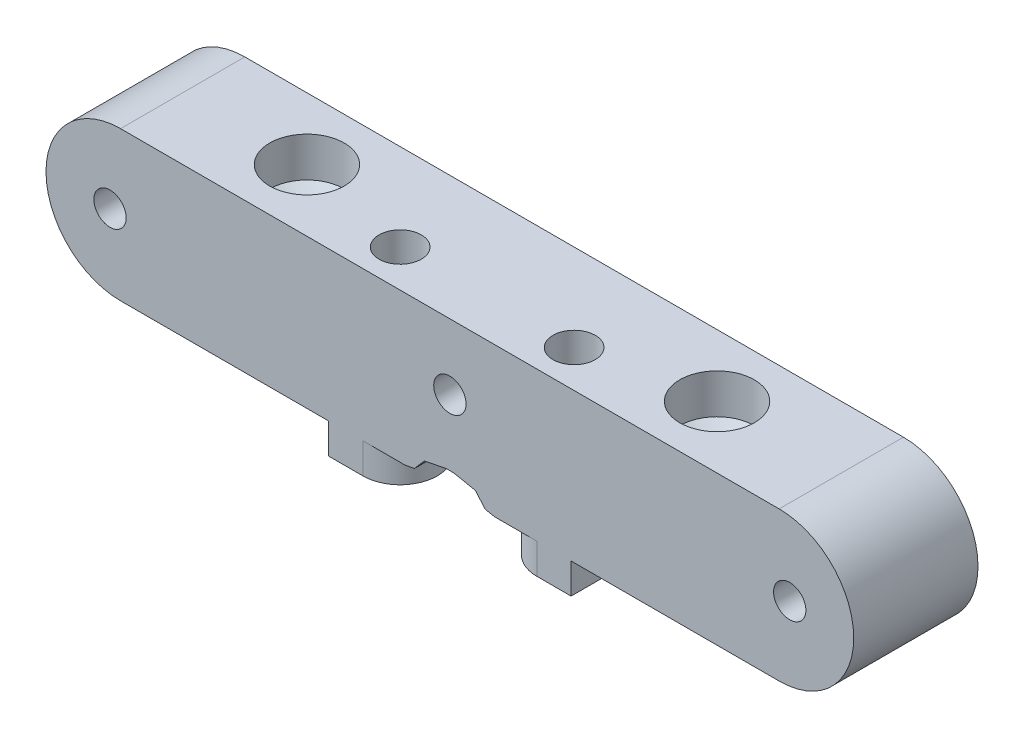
ISO-10303-21;
HEADER;
FILE_DESCRIPTION(('STEP AP214'),'2;1');
FILE_NAME('part.step','',(''),(''),'','','');
FILE_SCHEMA(('AUTOMOTIVE_DESIGN { 1 0 10303 214 1 1 1 1 }'));
ENDSEC;
DATA;
#1=APPLICATION_CONTEXT('core data for automotive mechanical design processes');
#2=APPLICATION_PROTOCOL_DEFINITION('international standard','automotive_design',2000,#1);
#3=PRODUCT_CONTEXT('',#1,'mechanical');
#4=PRODUCT('Part','Part','',(#3));
#5=PRODUCT_RELATED_PRODUCT_CATEGORY('part','',(#4));
#6=PRODUCT_DEFINITION_FORMATION('','',#4);
#7=PRODUCT_DEFINITION_CONTEXT('part definition',#1,'design');
#8=PRODUCT_DEFINITION('design','',#6,#7);
#9=PRODUCT_DEFINITION_SHAPE('','',#8);
#10=(LENGTH_UNIT() NAMED_UNIT(*) SI_UNIT(.MILLI.,.METRE.));
#11=(NAMED_UNIT(*) PLANE_ANGLE_UNIT() SI_UNIT($,.RADIAN.));
#12=(NAMED_UNIT(*) SI_UNIT($,.STERADIAN.) SOLID_ANGLE_UNIT());
#13=UNCERTAINTY_MEASURE_WITH_UNIT(LENGTH_MEASURE(1.E-05),#10,'distance_accuracy_value','');
#14=(GEOMETRIC_REPRESENTATION_CONTEXT(3) GLOBAL_UNCERTAINTY_ASSIGNED_CONTEXT((#13)) GLOBAL_UNIT_ASSIGNED_CONTEXT((#10,
#11,#12)) REPRESENTATION_CONTEXT('',''));
#15=CARTESIAN_POINT('',(0.,0.,0.));
#16=DIRECTION('',(0.,0.,1.));
#17=DIRECTION('',(1.,0.,0.));
#18=AXIS2_PLACEMENT_3D('',#15,#16,#17);
#19=CARTESIAN_POINT('',(-1.75009586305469E-10,55.1652977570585,0.));
#20=DIRECTION('',(3.17245792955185E-12,-1.,0.));
#21=DIRECTION('',(1.,3.17245792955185E-12,0.));
#22=AXIS2_PLACEMENT_3D('',#19,#20,#21);
#23=PLANE('',#22);
#24=CARTESIAN_POINT('',(2.49999999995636,55.1652977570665,-5.));
#25=DIRECTION('',(-3.17245792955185E-12,1.,0.));
#26=DIRECTION('',(-1.,-3.17245792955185E-12,0.));
#27=AXIS2_PLACEMENT_3D('',#24,#25,#26);
#28=CIRCLE('',#27,1.7);
#29=CARTESIAN_POINT('',(0.799999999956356,55.1652977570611,-5.));
#30=VERTEX_POINT('',#29);
#31=EDGE_CURVE('E368',#30,#30,#28,.T.);
#32=ORIENTED_EDGE('',*,*,#31,.T.);
#33=EDGE_LOOP('',(#32));
#34=FACE_BOUND('',#33,.T.);
#35=DIRECTION('',(1.,3.17245792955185E-12,0.));
#36=VECTOR('',#35,1.);
#37=CARTESIAN_POINT('',(-3.50000000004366,55.1652977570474,0.));
#38=LINE('',#37,#36);
#39=CARTESIAN_POINT('',(12.0000309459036,55.1652977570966,0.));
#40=VERTEX_POINT('',#39);
#41=CARTESIAN_POINT('',(15.4049397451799,55.1652977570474,0.));
#42=VERTEX_POINT('',#41);
#43=EDGE_CURVE('E381',#40,#42,#38,.T.);
#44=ORIENTED_EDGE('',*,*,#43,.F.);
#45=CARTESIAN_POINT('',(12.0000309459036,55.1652977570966,-3.00000000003));
#46=DIRECTION('',(3.17245792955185E-12,-1.,0.));
#47=DIRECTION('',(1.,3.17245792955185E-12,0.));
#48=AXIS2_PLACEMENT_3D('',#45,#46,#47);
#49=CIRCLE('',#48,3.00000000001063);
#50=CARTESIAN_POINT('',(12.0000309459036,55.1652977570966,-6.00000000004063));
#51=VERTEX_POINT('',#50);
#52=EDGE_CURVE('E60',#51,#40,#49,.T.);
#53=ORIENTED_EDGE('',*,*,#52,.F.);
#54=DIRECTION('',(1.,3.17251022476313E-12,-1.47436747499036E-11));
#55=VECTOR('',#54,1.);
#56=CARTESIAN_POINT('',(12.0000309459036,55.1652977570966,-6.00000000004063));
#57=LINE('',#56,#55);
#58=CARTESIAN_POINT('',(9.24416707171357,55.1652977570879,-6.));
#59=VERTEX_POINT('',#58);
#60=EDGE_CURVE('E266',#59,#51,#57,.T.);
#61=ORIENTED_EDGE('',*,*,#60,.F.);
#62=DIRECTION('',(-7.49978782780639E-12,0.,-1.));
#63=VECTOR('',#62,1.);
#64=CARTESIAN_POINT('',(9.24416707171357,55.1652977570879,-6.));
#65=LINE('',#64,#63);
#66=CARTESIAN_POINT('',(9.24416707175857,55.1652977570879,0.));
#67=VERTEX_POINT('',#66);
#68=EDGE_CURVE('E275',#67,#59,#65,.T.);
#69=ORIENTED_EDGE('',*,*,#68,.F.);
#70=CARTESIAN_POINT('',(-7.5000000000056,55.1652977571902,0.));
#71=VERTEX_POINT('',#70);
#72=EDGE_CURVE('E376',#71,#67,#38,.T.);
#73=ORIENTED_EDGE('',*,*,#72,.F.);
#74=DIRECTION('',(0.,0.,-1.));
#75=VECTOR('',#74,1.);
#76=CARTESIAN_POINT('',(-7.5000000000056,55.1652977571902,15.6204993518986));
#77=LINE('',#76,#75);
#78=CARTESIAN_POINT('',(-7.5000000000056,55.1652977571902,-9.99999999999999));
#79=VERTEX_POINT('',#78);
#80=EDGE_CURVE('E206',#71,#79,#77,.T.);
#81=ORIENTED_EDGE('',*,*,#80,.T.);
#82=DIRECTION('',(-1.,-3.17245792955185E-12,0.));
#83=VECTOR('',#82,1.);
#84=CARTESIAN_POINT('',(-3.50000000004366,55.1652977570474,-9.99999999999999));
#85=LINE('',#84,#83);
#86=CARTESIAN_POINT('',(15.4049397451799,55.1652977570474,-9.99999999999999));
#87=VERTEX_POINT('',#86);
#88=EDGE_CURVE('E211',#87,#79,#85,.T.);
#89=ORIENTED_EDGE('',*,*,#88,.F.);
#90=DIRECTION('',(0.,0.,-1.));
#91=VECTOR('',#90,1.);
#92=CARTESIAN_POINT('',(15.4049397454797,55.1652977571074,0.));
#93=LINE('',#92,#91);
#94=EDGE_CURVE('E366',#42,#87,#93,.T.);
#95=ORIENTED_EDGE('',*,*,#94,.F.);
#96=EDGE_LOOP('',(#44,#53,#61,#69,#73,#81,#89,#95));
#97=FACE_BOUND('',#96,.T.);
#98=ADVANCED_FACE('F40',(#34,#97),#23,.T.);
#99=CARTESIAN_POINT('',(35.500059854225,55.1652977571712,-5.));
#100=DIRECTION('',(-3.17245792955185E-12,1.,0.));
#101=DIRECTION('',(-1.,-3.17245792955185E-12,0.));
#102=AXIS2_PLACEMENT_3D('',#99,#100,#101);
#103=CIRCLE('',#102,1.7);
#104=CARTESIAN_POINT('',(33.800059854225,55.1652977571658,-5.));
#105=VERTEX_POINT('',#104);
#106=EDGE_CURVE('E372',#105,#105,#103,.T.);
#107=ORIENTED_EDGE('',*,*,#106,.T.);
#108=EDGE_LOOP('',(#107));
#109=FACE_BOUND('',#108,.T.);
#110=DIRECTION('',(1.,3.17251022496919E-12,1.43609592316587E-11));
#111=VECTOR('',#110,1.);
#112=CARTESIAN_POINT('',(28.7558948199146,55.1652977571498,-6.));
#113=LINE('',#112,#111);
#114=CARTESIAN_POINT('',(26.0000309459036,55.165297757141,-6.00000000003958));
#115=VERTEX_POINT('',#114);
#116=CARTESIAN_POINT('',(28.7558948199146,55.1652977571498,-6.));
#117=VERTEX_POINT('',#116);
#118=EDGE_CURVE('E301',#115,#117,#113,.T.);
#119=ORIENTED_EDGE('',*,*,#118,.F.);
#120=CARTESIAN_POINT('',(26.0000309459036,55.165297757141,-3.00000000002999));
#121=DIRECTION('',(3.17245792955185E-12,-1.,0.));
#122=DIRECTION('',(1.,3.17245792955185E-12,0.));
#123=AXIS2_PLACEMENT_3D('',#120,#121,#122);
#124=CIRCLE('',#123,3.00000000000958);
#125=CARTESIAN_POINT('',(26.0000380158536,55.165297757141,-2.87426332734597E-11));
#126=VERTEX_POINT('',#125);
#127=EDGE_CURVE('E299',#126,#115,#124,.T.);
#128=ORIENTED_EDGE('',*,*,#127,.F.);
#129=CARTESIAN_POINT('',(22.5951221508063,55.1652977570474,0.));
#130=VERTEX_POINT('',#129);
#131=EDGE_CURVE('E382',#130,#126,#38,.T.);
#132=ORIENTED_EDGE('',*,*,#131,.F.);
#133=DIRECTION('',(0.,0.,1.));
#134=VECTOR('',#133,1.);
#135=CARTESIAN_POINT('',(22.5951221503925,55.1652977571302,0.));
#136=LINE('',#135,#134);
#137=CARTESIAN_POINT('',(22.5951221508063,55.1652977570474,-9.99999999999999));
#138=VERTEX_POINT('',#137);
#139=EDGE_CURVE('E353',#138,#130,#136,.T.);
#140=ORIENTED_EDGE('',*,*,#139,.F.);
#141=CARTESIAN_POINT('',(45.5000618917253,55.1652977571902,-9.99999999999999));
#142=VERTEX_POINT('',#141);
#143=EDGE_CURVE('E196',#142,#138,#85,.T.);
#144=ORIENTED_EDGE('',*,*,#143,.F.);
#145=DIRECTION('',(0.,0.,-1.));
#146=VECTOR('',#145,1.);
#147=CARTESIAN_POINT('',(45.5000618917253,55.1652977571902,15.6204993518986));
#148=LINE('',#147,#146);
#149=CARTESIAN_POINT('',(45.5000618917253,55.1652977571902,0.));
#150=VERTEX_POINT('',#149);
#151=EDGE_CURVE('E227',#150,#142,#148,.T.);
#152=ORIENTED_EDGE('',*,*,#151,.F.);
#153=CARTESIAN_POINT('',(28.7558948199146,55.1652977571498,0.));
#154=VERTEX_POINT('',#153);
#155=EDGE_CURVE('E374',#154,#150,#38,.T.);
#156=ORIENTED_EDGE('',*,*,#155,.F.);
#157=DIRECTION('',(-1.71107341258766E-11,0.,1.));
#158=VECTOR('',#157,1.);
#159=CARTESIAN_POINT('',(28.7558948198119,55.1652977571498,0.));
#160=LINE('',#159,#158);
#161=EDGE_CURVE('E293',#117,#154,#160,.T.);
#162=ORIENTED_EDGE('',*,*,#161,.F.);
#163=EDGE_LOOP('',(#119,#128,#132,#140,#144,#152,#156,#162));
#164=FACE_BOUND('',#163,.T.);
#165=ADVANCED_FACE('F445',(#109,#164),#23,.T.);
#166=CARTESIAN_POINT('',(-2.13079081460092E-10,67.1652977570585,0.));
#167=DIRECTION('',(3.17245792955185E-12,-1.,0.));
#168=DIRECTION('',(1.,3.17245792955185E-12,0.));
#169=AXIS2_PLACEMENT_3D('',#166,#167,#168);
#170=PLANE('',#169);
#171=CARTESIAN_POINT('',(35.5000598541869,67.1652977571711,-5.));
#172=DIRECTION('',(0.,1.,0.));
#173=DIRECTION('',(0.,0.,1.));
#174=AXIS2_PLACEMENT_3D('',#171,#172,#173);
#175=CIRCLE('',#174,2.99999999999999);
#176=CARTESIAN_POINT('',(35.5000598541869,67.1652977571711,-2.00000000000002));
#177=VERTEX_POINT('',#176);
#178=EDGE_CURVE('E224',#177,#177,#175,.T.);
#179=ORIENTED_EDGE('',*,*,#178,.F.);
#180=EDGE_LOOP('',(#179));
#181=FACE_BOUND('',#180,.T.);
#182=CARTESIAN_POINT('',(2.49999999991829,67.1652977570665,-5.));
#183=DIRECTION('',(0.,1.,0.));
#184=DIRECTION('',(0.,0.,1.));
#185=AXIS2_PLACEMENT_3D('',#182,#183,#184);
#186=CIRCLE('',#185,2.99999999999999);
#187=CARTESIAN_POINT('',(2.49999999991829,67.1652977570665,-2.00000000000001));
#188=VERTEX_POINT('',#187);
#189=EDGE_CURVE('E237',#188,#188,#186,.T.);
#190=ORIENTED_EDGE('',*,*,#189,.F.);
#191=EDGE_LOOP('',(#190));
#192=FACE_BOUND('',#191,.T.);
#193=CARTESIAN_POINT('',(12.0000309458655,67.1652977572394,-3.00000000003));
#194=DIRECTION('',(3.17245792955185E-12,-1.,0.));
#195=DIRECTION('',(1.,3.17245792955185E-12,0.));
#196=AXIS2_PLACEMENT_3D('',#193,#194,#195);
#197=CIRCLE('',#196,1.6999999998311);
#198=CARTESIAN_POINT('',(13.7000309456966,67.1652977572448,-3.00000000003));
#199=VERTEX_POINT('',#198);
#200=EDGE_CURVE('E246',#199,#199,#197,.T.);
#201=ORIENTED_EDGE('',*,*,#200,.T.);
#202=EDGE_LOOP('',(#201));
#203=FACE_BOUND('',#202,.T.);
#204=CARTESIAN_POINT('',(26.0000309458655,67.1652977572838,-3.00000000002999));
#205=DIRECTION('',(3.17245792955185E-12,-1.,0.));
#206=DIRECTION('',(1.,3.17245792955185E-12,0.));
#207=AXIS2_PLACEMENT_3D('',#204,#205,#206);
#208=CIRCLE('',#207,1.69999999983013);
#209=CARTESIAN_POINT('',(27.7000309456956,67.1652977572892,-3.00000000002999));
#210=VERTEX_POINT('',#209);
#211=EDGE_CURVE('E254',#210,#210,#208,.T.);
#212=ORIENTED_EDGE('',*,*,#211,.T.);
#213=EDGE_LOOP('',(#212));
#214=FACE_BOUND('',#213,.T.);
#215=DIRECTION('',(-1.,-3.17245792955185E-12,0.));
#216=VECTOR('',#215,1.);
#217=CARTESIAN_POINT('',(-3.50000000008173,67.1652977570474,-9.99999999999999));
#218=LINE('',#217,#216);
#219=CARTESIAN_POINT('',(45.5000618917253,67.1652977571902,-9.99999999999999));
#220=VERTEX_POINT('',#219);
#221=CARTESIAN_POINT('',(-7.5000000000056,67.1652977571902,-9.99999999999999));
#222=VERTEX_POINT('',#221);
#223=EDGE_CURVE('E49',#220,#222,#218,.T.);
#224=ORIENTED_EDGE('',*,*,#223,.T.);
#225=DIRECTION('',(0.,0.,-1.));
#226=VECTOR('',#225,1.);
#227=CARTESIAN_POINT('',(-7.5000000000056,67.1652977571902,15.6204993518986));
#228=LINE('',#227,#226);
#229=CARTESIAN_POINT('',(-7.5000000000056,67.1652977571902,0.));
#230=VERTEX_POINT('',#229);
#231=EDGE_CURVE('E188',#230,#222,#228,.T.);
#232=ORIENTED_EDGE('',*,*,#231,.F.);
#233=DIRECTION('',(-1.,-1.50274040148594E-11,0.));
#234=VECTOR('',#233,1.);
#235=CARTESIAN_POINT('',(-3.50000000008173,67.1652977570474,0.));
#236=LINE('',#235,#234);
#237=CARTESIAN_POINT('',(45.5000618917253,67.1652977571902,0.));
#238=VERTEX_POINT('',#237);
#239=EDGE_CURVE('E250',#238,#230,#236,.T.);
#240=ORIENTED_EDGE('',*,*,#239,.F.);
#241=DIRECTION('',(0.,0.,-1.));
#242=VECTOR('',#241,1.);
#243=CARTESIAN_POINT('',(45.5000618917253,67.1652977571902,15.6204993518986));
#244=LINE('',#243,#242);
#245=EDGE_CURVE('E190',#238,#220,#244,.T.);
#246=ORIENTED_EDGE('',*,*,#245,.T.);
#247=EDGE_LOOP('',(#224,#232,#240,#246));
#248=FACE_BOUND('',#247,.T.);
#249=ADVANCED_FACE('F187',(#181,#192,#203,#214,#248),#170,.F.);
#250=CARTESIAN_POINT('',(-3.50000000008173,67.1652977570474,0.));
#251=DIRECTION('',(0.,0.,-1.));
#252=DIRECTION('',(-1.,0.,0.));
#253=AXIS2_PLACEMENT_3D('',#250,#251,#252);
#254=PLANE('',#253);
#255=CARTESIAN_POINT('',(-8.3500000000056,61.1652977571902,0.));
#256=DIRECTION('',(0.,0.,-1.));
#257=DIRECTION('',(-1.,0.,0.));
#258=AXIS2_PLACEMENT_3D('',#255,#256,#257);
#259=CIRCLE('',#258,1.3);
#260=CARTESIAN_POINT('',(-9.6500000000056,61.1652977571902,0.));
#261=VERTEX_POINT('',#260);
#262=EDGE_CURVE('E213',#261,#261,#259,.T.);
#263=ORIENTED_EDGE('',*,*,#262,.T.);
#264=EDGE_LOOP('',(#263));
#265=FACE_BOUND('',#264,.T.);
#266=CARTESIAN_POINT('',(46.3500618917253,61.1652977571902,0.));
#267=DIRECTION('',(0.,0.,-1.));
#268=DIRECTION('',(-1.,0.,0.));
#269=AXIS2_PLACEMENT_3D('',#266,#267,#268);
#270=CIRCLE('',#269,1.3);
#271=CARTESIAN_POINT('',(45.0500618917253,61.1652977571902,0.));
#272=VERTEX_POINT('',#271);
#273=EDGE_CURVE('E216',#272,#272,#270,.T.);
#274=ORIENTED_EDGE('',*,*,#273,.T.);
#275=EDGE_LOOP('',(#274));
#276=FACE_BOUND('',#275,.T.);
#277=CARTESIAN_POINT('',(19.0000309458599,61.8726338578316,0.));
#278=DIRECTION('',(0.,0.,-1.));
#279=DIRECTION('',(-1.,0.,0.));
#280=AXIS2_PLACEMENT_3D('',#277,#278,#279);
#281=CIRCLE('',#280,1.3000000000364);
#282=CARTESIAN_POINT('',(17.7000309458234,61.8726338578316,0.));
#283=VERTEX_POINT('',#282);
#284=EDGE_CURVE('E401',#283,#283,#281,.T.);
#285=ORIENTED_EDGE('',*,*,#284,.T.);
#286=EDGE_LOOP('',(#285));
#287=FACE_BOUND('',#286,.T.);
#288=ORIENTED_EDGE('',*,*,#155,.T.);
#289=CARTESIAN_POINT('',(45.5000618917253,61.1652977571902,0.));
#290=DIRECTION('',(0.,0.,-1.));
#291=DIRECTION('',(-1.,0.,0.));
#292=AXIS2_PLACEMENT_3D('',#289,#290,#291);
#293=CIRCLE('',#292,6.);
#294=EDGE_CURVE('E221',#150,#238,#293,.F.);
#295=ORIENTED_EDGE('',*,*,#294,.T.);
#296=ORIENTED_EDGE('',*,*,#239,.T.);
#297=CARTESIAN_POINT('',(-7.5000000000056,61.1652977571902,0.));
#298=DIRECTION('',(0.,0.,-1.));
#299=DIRECTION('',(-1.,0.,0.));
#300=AXIS2_PLACEMENT_3D('',#297,#298,#299);
#301=CIRCLE('',#300,6.);
#302=EDGE_CURVE('E205',#230,#71,#301,.F.);
#303=ORIENTED_EDGE('',*,*,#302,.T.);
#304=ORIENTED_EDGE('',*,*,#72,.T.);
#305=DIRECTION('',(-3.17245792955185E-12,1.,0.));
#306=VECTOR('',#305,1.);
#307=CARTESIAN_POINT('',(9.24416707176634,52.7152977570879,0.));
#308=LINE('',#307,#306);
#309=CARTESIAN_POINT('',(9.24416707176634,52.7152977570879,0.));
#310=VERTEX_POINT('',#309);
#311=EDGE_CURVE('E285',#310,#67,#308,.T.);
#312=ORIENTED_EDGE('',*,*,#311,.F.);
#313=DIRECTION('',(-1.,-3.1725212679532E-12,1.25928321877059E-11));
#314=VECTOR('',#313,1.);
#315=CARTESIAN_POINT('',(9.24416707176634,52.7152977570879,0.));
#316=LINE('',#315,#314);
#317=CARTESIAN_POINT('',(12.0000213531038,52.7152977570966,-3.47009668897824E-11));
#318=VERTEX_POINT('',#317);
#319=EDGE_CURVE('E265',#318,#310,#316,.T.);
#320=ORIENTED_EDGE('',*,*,#319,.F.);
#321=DIRECTION('',(-3.17245792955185E-12,1.,0.));
#322=VECTOR('',#321,1.);
#323=CARTESIAN_POINT('',(12.0000213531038,52.7152977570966,-3.47009668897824E-11));
#324=LINE('',#323,#322);
#325=EDGE_CURVE('E288',#318,#40,#324,.T.);
#326=ORIENTED_EDGE('',*,*,#325,.T.);
#327=ORIENTED_EDGE('',*,*,#43,.T.);
#328=DIRECTION('',(0.980562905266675,0.19620496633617,0.));
#329=VECTOR('',#328,1.);
#330=CARTESIAN_POINT('',(9.61383210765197,54.0065306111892,0.));
#331=LINE('',#330,#329);
#332=CARTESIAN_POINT('',(16.1573875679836,55.3158582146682,0.));
#333=VERTEX_POINT('',#332);
#334=EDGE_CURVE('E330',#42,#333,#331,.T.);
#335=ORIENTED_EDGE('',*,*,#334,.T.);
#336=DIRECTION('',(0.655175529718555,0.755476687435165,0.));
#337=VECTOR('',#336,1.);
#338=CARTESIAN_POINT('',(16.1573875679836,55.3158582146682,0.));
#339=LINE('',#338,#337);
#340=CARTESIAN_POINT('',(16.9502580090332,56.2301095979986,0.));
#341=VERTEX_POINT('',#340);
#342=EDGE_CURVE('E333',#333,#341,#339,.T.);
#343=ORIENTED_EDGE('',*,*,#342,.T.);
#344=DIRECTION('',(0.980600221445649,0.196018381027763,0.));
#345=VECTOR('',#344,1.);
#346=CARTESIAN_POINT('',(16.9502580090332,56.2301095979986,0.));
#347=LINE('',#346,#345);
#348=CARTESIAN_POINT('',(18.7004670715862,56.5799699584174,0.));
#349=VERTEX_POINT('',#348);
#350=EDGE_CURVE('E314',#341,#349,#347,.T.);
#351=ORIENTED_EDGE('',*,*,#350,.T.);
#352=DIRECTION('',(1.,9.27575153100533E-11,0.));
#353=VECTOR('',#352,1.);
#354=CARTESIAN_POINT('',(18.7004670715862,56.5799699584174,0.));
#355=LINE('',#354,#353);
#356=CARTESIAN_POINT('',(19.2995948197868,56.579969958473,0.));
#357=VERTEX_POINT('',#356);
#358=EDGE_CURVE('E317',#349,#357,#355,.T.);
#359=ORIENTED_EDGE('',*,*,#358,.T.);
#360=DIRECTION('',(0.980600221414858,-0.196018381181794,0.));
#361=VECTOR('',#360,1.);
#362=CARTESIAN_POINT('',(19.2995948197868,56.579969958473,0.));
#363=LINE('',#362,#361);
#364=CARTESIAN_POINT('',(21.0498040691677,56.2301095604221,0.));
#365=VERTEX_POINT('',#364);
#366=EDGE_CURVE('E321',#357,#365,#363,.T.);
#367=ORIENTED_EDGE('',*,*,#366,.T.);
#368=DIRECTION('',(0.655175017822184,-0.755477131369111,0.));
#369=VECTOR('',#368,1.);
#370=CARTESIAN_POINT('',(21.0498040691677,56.2301095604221,0.));
#371=LINE('',#370,#369);
#372=CARTESIAN_POINT('',(21.842673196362,55.3158584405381,0.));
#373=VERTEX_POINT('',#372);
#374=EDGE_CURVE('E324',#365,#373,#371,.T.);
#375=ORIENTED_EDGE('',*,*,#374,.T.);
#376=DIRECTION('',(0.980562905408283,-0.196204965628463,0.));
#377=VECTOR('',#376,1.);
#378=CARTESIAN_POINT('',(21.842673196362,55.3158584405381,0.));
#379=LINE('',#378,#377);
#380=EDGE_CURVE('E327',#373,#130,#379,.T.);
#381=ORIENTED_EDGE('',*,*,#380,.T.);
#382=ORIENTED_EDGE('',*,*,#131,.T.);
#383=DIRECTION('',(-3.17245792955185E-12,1.,0.));
#384=VECTOR('',#383,1.);
#385=CARTESIAN_POINT('',(26.0000380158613,52.715297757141,-2.87426332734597E-11));
#386=LINE('',#385,#384);
#387=CARTESIAN_POINT('',(26.0000380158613,52.715297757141,-2.87426332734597E-11));
#388=VERTEX_POINT('',#387);
#389=EDGE_CURVE('E311',#388,#126,#386,.T.);
#390=ORIENTED_EDGE('',*,*,#389,.F.);
#391=DIRECTION('',(-1.,-3.1725183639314E-12,-1.04313851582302E-11));
#392=VECTOR('',#391,1.);
#393=CARTESIAN_POINT('',(26.0000380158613,52.715297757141,-2.87426254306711E-11));
#394=LINE('',#393,#392);
#395=CARTESIAN_POINT('',(28.7558948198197,52.7152977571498,0.));
#396=VERTEX_POINT('',#395);
#397=EDGE_CURVE('E289',#396,#388,#394,.T.);
#398=ORIENTED_EDGE('',*,*,#397,.F.);
#399=DIRECTION('',(-3.17245792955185E-12,1.,0.));
#400=VECTOR('',#399,1.);
#401=CARTESIAN_POINT('',(28.7558948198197,52.7152977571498,0.));
#402=LINE('',#401,#400);
#403=EDGE_CURVE('E68',#396,#154,#402,.T.);
#404=ORIENTED_EDGE('',*,*,#403,.T.);
#405=EDGE_LOOP('',(#288,#295,#296,#303,#304,#312,#320,#326,#327,#335,#343,#351,#359,#367,#375,
#381,#382,#390,#398,#404));
#406=FACE_BOUND('',#405,.T.);
#407=ADVANCED_FACE('F42',(#265,#276,#287,#406),#254,.F.);
#408=CARTESIAN_POINT('',(-3.50000000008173,67.1652977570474,-9.99999999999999));
#409=DIRECTION('',(0.,0.,1.));
#410=DIRECTION('',(1.,0.,0.));
#411=AXIS2_PLACEMENT_3D('',#408,#409,#410);
#412=PLANE('',#411);
#413=CARTESIAN_POINT('',(19.0000309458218,61.8726338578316,-9.99999999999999));
#414=DIRECTION('',(0.,0.,-1.));
#415=DIRECTION('',(-1.,0.,0.));
#416=AXIS2_PLACEMENT_3D('',#413,#414,#415);
#417=CIRCLE('',#416,2.3);
#418=CARTESIAN_POINT('',(16.7000309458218,61.8726338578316,-9.99999999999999));
#419=VERTEX_POINT('',#418);
#420=EDGE_CURVE('E468',#419,#419,#417,.T.);
#421=ORIENTED_EDGE('',*,*,#420,.F.);
#422=EDGE_LOOP('',(#421));
#423=FACE_BOUND('',#422,.T.);
#424=CARTESIAN_POINT('',(46.3500618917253,61.1652977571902,-9.99999999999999));
#425=DIRECTION('',(0.,0.,-1.));
#426=DIRECTION('',(-1.,0.,0.));
#427=AXIS2_PLACEMENT_3D('',#424,#425,#426);
#428=CIRCLE('',#427,2.3);
#429=CARTESIAN_POINT('',(44.0500618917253,61.1652977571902,-9.99999999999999));
#430=VERTEX_POINT('',#429);
#431=EDGE_CURVE('E412',#430,#430,#428,.T.);
#432=ORIENTED_EDGE('',*,*,#431,.F.);
#433=EDGE_LOOP('',(#432));
#434=FACE_BOUND('',#433,.T.);
#435=CARTESIAN_POINT('',(-8.3500000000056,61.1652977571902,-9.99999999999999));
#436=DIRECTION('',(0.,0.,-1.));
#437=DIRECTION('',(-1.,0.,0.));
#438=AXIS2_PLACEMENT_3D('',#435,#436,#437);
#439=CIRCLE('',#438,2.3);
#440=CARTESIAN_POINT('',(-10.6500000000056,61.1652977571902,-9.99999999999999));
#441=VERTEX_POINT('',#440);
#442=EDGE_CURVE('E405',#441,#441,#439,.T.);
#443=ORIENTED_EDGE('',*,*,#442,.F.);
#444=EDGE_LOOP('',(#443));
#445=FACE_BOUND('',#444,.T.);
#446=DIRECTION('',(0.655175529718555,0.755476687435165,0.));
#447=VECTOR('',#446,1.);
#448=CARTESIAN_POINT('',(16.1573875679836,55.3158582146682,-9.99999999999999));
#449=LINE('',#448,#447);
#450=CARTESIAN_POINT('',(16.1573875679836,55.3158582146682,-9.99999999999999));
#451=VERTEX_POINT('',#450);
#452=CARTESIAN_POINT('',(16.9502580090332,56.2301095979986,-9.99999999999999));
#453=VERTEX_POINT('',#452);
#454=EDGE_CURVE('E318',#451,#453,#449,.T.);
#455=ORIENTED_EDGE('',*,*,#454,.F.);
#456=DIRECTION('',(-0.980562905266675,-0.19620496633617,0.));
#457=VECTOR('',#456,1.);
#458=CARTESIAN_POINT('',(-0.463532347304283,51.9901082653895,-9.99999999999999));
#459=LINE('',#458,#457);
#460=EDGE_CURVE('E11',#451,#87,#459,.T.);
#461=ORIENTED_EDGE('',*,*,#460,.T.);
#462=ORIENTED_EDGE('',*,*,#88,.T.);
#463=CARTESIAN_POINT('',(-7.5000000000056,61.1652977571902,-9.99999999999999));
#464=DIRECTION('',(0.,0.,-1.));
#465=DIRECTION('',(1.,0.,0.));
#466=AXIS2_PLACEMENT_3D('',#463,#464,#465);
#467=CIRCLE('',#466,6.);
#468=EDGE_CURVE('E203',#79,#222,#467,.T.);
#469=ORIENTED_EDGE('',*,*,#468,.T.);
#470=ORIENTED_EDGE('',*,*,#223,.F.);
#471=CARTESIAN_POINT('',(45.5000618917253,61.1652977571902,-9.99999999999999));
#472=DIRECTION('',(0.,0.,-1.));
#473=DIRECTION('',(-1.,0.,0.));
#474=AXIS2_PLACEMENT_3D('',#471,#472,#473);
#475=CIRCLE('',#474,6.);
#476=EDGE_CURVE('E225',#220,#142,#475,.T.);
#477=ORIENTED_EDGE('',*,*,#476,.T.);
#478=ORIENTED_EDGE('',*,*,#143,.T.);
#479=DIRECTION('',(0.980562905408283,-0.196204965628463,0.));
#480=VECTOR('',#479,1.);
#481=CARTESIAN_POINT('',(21.842673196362,55.3158584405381,-9.99999999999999));
#482=LINE('',#481,#480);
#483=CARTESIAN_POINT('',(21.842673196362,55.3158584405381,-9.99999999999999));
#484=VERTEX_POINT('',#483);
#485=EDGE_CURVE('E347',#484,#138,#482,.T.);
#486=ORIENTED_EDGE('',*,*,#485,.F.);
#487=DIRECTION('',(0.655175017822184,-0.755477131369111,0.));
#488=VECTOR('',#487,1.);
#489=CARTESIAN_POINT('',(21.0498040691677,56.2301095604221,-9.99999999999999));
#490=LINE('',#489,#488);
#491=CARTESIAN_POINT('',(21.0498040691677,56.2301095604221,-9.99999999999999));
#492=VERTEX_POINT('',#491);
#493=EDGE_CURVE('E344',#492,#484,#490,.T.);
#494=ORIENTED_EDGE('',*,*,#493,.F.);
#495=DIRECTION('',(0.980600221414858,-0.196018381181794,0.));
#496=VECTOR('',#495,1.);
#497=CARTESIAN_POINT('',(19.2995948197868,56.579969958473,-9.99999999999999));
#498=LINE('',#497,#496);
#499=CARTESIAN_POINT('',(19.2995948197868,56.579969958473,-9.99999999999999));
#500=VERTEX_POINT('',#499);
#501=EDGE_CURVE('E341',#500,#492,#498,.T.);
#502=ORIENTED_EDGE('',*,*,#501,.F.);
#503=DIRECTION('',(1.,9.27575153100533E-11,0.));
#504=VECTOR('',#503,1.);
#505=CARTESIAN_POINT('',(18.7004670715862,56.5799699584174,-9.99999999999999));
#506=LINE('',#505,#504);
#507=CARTESIAN_POINT('',(18.7004670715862,56.5799699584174,-9.99999999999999));
#508=VERTEX_POINT('',#507);
#509=EDGE_CURVE('E338',#508,#500,#506,.T.);
#510=ORIENTED_EDGE('',*,*,#509,.F.);
#511=DIRECTION('',(0.980600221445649,0.196018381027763,0.));
#512=VECTOR('',#511,1.);
#513=CARTESIAN_POINT('',(16.9502580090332,56.2301095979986,-9.99999999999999));
#514=LINE('',#513,#512);
#515=EDGE_CURVE('E313',#453,#508,#514,.T.);
#516=ORIENTED_EDGE('',*,*,#515,.F.);
#517=EDGE_LOOP('',(#455,#461,#462,#469,#470,#477,#478,#486,#494,#502,#510,#516));
#518=FACE_BOUND('',#517,.T.);
#519=ADVANCED_FACE('F209',(#423,#434,#445,#518),#412,.F.);
#520=CARTESIAN_POINT('',(35.5000598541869,67.1652977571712,-5.));
#521=DIRECTION('',(3.17245792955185E-12,-1.,0.));
#522=DIRECTION('',(1.,3.17245792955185E-12,0.));
#523=AXIS2_PLACEMENT_3D('',#520,#521,#522);
#524=CYLINDRICAL_SURFACE('',#523,1.7);
#525=CARTESIAN_POINT('',(35.5000598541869,63.186760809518,-5.));
#526=DIRECTION('',(0.,1.,0.));
#527=DIRECTION('',(0.,0.,1.));
#528=AXIS2_PLACEMENT_3D('',#525,#526,#527);
#529=CIRCLE('',#528,1.7);
#530=CARTESIAN_POINT('',(35.5000598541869,63.186760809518,-3.30000000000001));
#531=VERTEX_POINT('',#530);
#532=EDGE_CURVE('E236',#531,#531,#529,.F.);
#533=ORIENTED_EDGE('',*,*,#532,.F.);
#534=EDGE_LOOP('',(#533));
#535=FACE_BOUND('',#534,.T.);
#536=ORIENTED_EDGE('',*,*,#106,.F.);
#537=EDGE_LOOP('',(#536));
#538=FACE_BOUND('',#537,.T.);
#539=ADVANCED_FACE('F456',(#535,#538),#524,.F.);
#540=CARTESIAN_POINT('',(2.49999999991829,67.1652977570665,-5.));
#541=DIRECTION('',(3.17245792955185E-12,-1.,0.));
#542=DIRECTION('',(1.,3.17245792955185E-12,0.));
#543=AXIS2_PLACEMENT_3D('',#540,#541,#542);
#544=CYLINDRICAL_SURFACE('',#543,1.7);
#545=CARTESIAN_POINT('',(2.49999999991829,63.1867608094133,-5.));
#546=DIRECTION('',(0.,1.,0.));
#547=DIRECTION('',(0.,0.,1.));
#548=AXIS2_PLACEMENT_3D('',#545,#546,#547);
#549=CIRCLE('',#548,1.7);
#550=CARTESIAN_POINT('',(2.49999999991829,63.1867608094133,-3.3));
#551=VERTEX_POINT('',#550);
#552=EDGE_CURVE('E245',#551,#551,#549,.F.);
#553=ORIENTED_EDGE('',*,*,#552,.F.);
#554=EDGE_LOOP('',(#553));
#555=FACE_BOUND('',#554,.T.);
#556=ORIENTED_EDGE('',*,*,#31,.F.);
#557=EDGE_LOOP('',(#556));
#558=FACE_BOUND('',#557,.T.);
#559=ADVANCED_FACE('F462',(#555,#558),#544,.F.);
#560=CARTESIAN_POINT('',(16.9502580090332,56.2301095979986,0.));
#561=DIRECTION('',(-0.196018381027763,0.980600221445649,0.));
#562=DIRECTION('',(-0.980600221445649,-0.196018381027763,0.));
#563=AXIS2_PLACEMENT_3D('',#560,#561,#562);
#564=PLANE('',#563);
#565=ORIENTED_EDGE('',*,*,#515,.T.);
#566=DIRECTION('',(0.,0.,-1.));
#567=VECTOR('',#566,1.);
#568=CARTESIAN_POINT('',(18.7004670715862,56.5799699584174,0.));
#569=LINE('',#568,#567);
#570=EDGE_CURVE('E336',#349,#508,#569,.T.);
#571=ORIENTED_EDGE('',*,*,#570,.F.);
#572=ORIENTED_EDGE('',*,*,#350,.F.);
#573=DIRECTION('',(0.,0.,-1.));
#574=VECTOR('',#573,1.);
#575=CARTESIAN_POINT('',(16.9502580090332,56.2301095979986,0.));
#576=LINE('',#575,#574);
#577=EDGE_CURVE('E351',#341,#453,#576,.T.);
#578=ORIENTED_EDGE('',*,*,#577,.T.);
#579=EDGE_LOOP('',(#565,#571,#572,#578));
#580=FACE_BOUND('',#579,.T.);
#581=ADVANCED_FACE('F541',(#580),#564,.F.);
#582=CARTESIAN_POINT('',(16.1573875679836,55.3158582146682,0.));
#583=DIRECTION('',(-0.755476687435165,0.655175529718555,0.));
#584=DIRECTION('',(-0.655175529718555,-0.755476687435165,0.));
#585=AXIS2_PLACEMENT_3D('',#582,#583,#584);
#586=PLANE('',#585);
#587=ORIENTED_EDGE('',*,*,#454,.T.);
#588=ORIENTED_EDGE('',*,*,#577,.F.);
#589=ORIENTED_EDGE('',*,*,#342,.F.);
#590=DIRECTION('',(0.,0.,-1.));
#591=VECTOR('',#590,1.);
#592=CARTESIAN_POINT('',(16.1573875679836,55.3158582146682,0.));
#593=LINE('',#592,#591);
#594=EDGE_CURVE('E354',#333,#451,#593,.T.);
#595=ORIENTED_EDGE('',*,*,#594,.T.);
#596=EDGE_LOOP('',(#587,#588,#589,#595));
#597=FACE_BOUND('',#596,.T.);
#598=ADVANCED_FACE('F544',(#597),#586,.F.);
#599=CARTESIAN_POINT('',(9.61383210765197,54.0065306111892,0.));
#600=DIRECTION('',(-0.19620496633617,0.980562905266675,0.));
#601=DIRECTION('',(-0.980562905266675,-0.19620496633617,0.));
#602=AXIS2_PLACEMENT_3D('',#599,#600,#601);
#603=PLANE('',#602);
#604=ORIENTED_EDGE('',*,*,#94,.T.);
#605=ORIENTED_EDGE('',*,*,#460,.F.);
#606=ORIENTED_EDGE('',*,*,#594,.F.);
#607=ORIENTED_EDGE('',*,*,#334,.F.);
#608=EDGE_LOOP('',(#604,#605,#606,#607));
#609=FACE_BOUND('',#608,.T.);
#610=ADVANCED_FACE('F596',(#609),#603,.F.);
#611=CARTESIAN_POINT('',(21.842673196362,55.3158584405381,0.));
#612=DIRECTION('',(0.196204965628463,0.980562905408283,0.));
#613=DIRECTION('',(-0.980562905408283,0.196204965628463,0.));
#614=AXIS2_PLACEMENT_3D('',#611,#612,#613);
#615=PLANE('',#614);
#616=ORIENTED_EDGE('',*,*,#139,.T.);
#617=ORIENTED_EDGE('',*,*,#380,.F.);
#618=DIRECTION('',(0.,0.,-1.));
#619=VECTOR('',#618,1.);
#620=CARTESIAN_POINT('',(21.842673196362,55.3158584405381,0.));
#621=LINE('',#620,#619);
#622=EDGE_CURVE('E357',#373,#484,#621,.T.);
#623=ORIENTED_EDGE('',*,*,#622,.T.);
#624=ORIENTED_EDGE('',*,*,#485,.T.);
#625=EDGE_LOOP('',(#616,#617,#623,#624));
#626=FACE_BOUND('',#625,.T.);
#627=ADVANCED_FACE('F526',(#626),#615,.F.);
#628=CARTESIAN_POINT('',(21.0498040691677,56.2301095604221,0.));
#629=DIRECTION('',(0.755477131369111,0.655175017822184,0.));
#630=DIRECTION('',(-0.655175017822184,0.755477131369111,0.));
#631=AXIS2_PLACEMENT_3D('',#628,#629,#630);
#632=PLANE('',#631);
#633=ORIENTED_EDGE('',*,*,#493,.T.);
#634=ORIENTED_EDGE('',*,*,#622,.F.);
#635=ORIENTED_EDGE('',*,*,#374,.F.);
#636=DIRECTION('',(0.,0.,-1.));
#637=VECTOR('',#636,1.);
#638=CARTESIAN_POINT('',(21.0498040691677,56.2301095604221,0.));
#639=LINE('',#638,#637);
#640=EDGE_CURVE('E359',#365,#492,#639,.T.);
#641=ORIENTED_EDGE('',*,*,#640,.T.);
#642=EDGE_LOOP('',(#633,#634,#635,#641));
#643=FACE_BOUND('',#642,.T.);
#644=ADVANCED_FACE('F530',(#643),#632,.F.);
#645=CARTESIAN_POINT('',(19.2995948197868,56.579969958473,0.));
#646=DIRECTION('',(0.196018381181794,0.980600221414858,0.));
#647=DIRECTION('',(-0.980600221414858,0.196018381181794,0.));
#648=AXIS2_PLACEMENT_3D('',#645,#646,#647);
#649=PLANE('',#648);
#650=ORIENTED_EDGE('',*,*,#501,.T.);
#651=ORIENTED_EDGE('',*,*,#640,.F.);
#652=ORIENTED_EDGE('',*,*,#366,.F.);
#653=DIRECTION('',(0.,0.,-1.));
#654=VECTOR('',#653,1.);
#655=CARTESIAN_POINT('',(19.2995948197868,56.579969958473,0.));
#656=LINE('',#655,#654);
#657=EDGE_CURVE('E361',#357,#500,#656,.T.);
#658=ORIENTED_EDGE('',*,*,#657,.T.);
#659=EDGE_LOOP('',(#650,#651,#652,#658));
#660=FACE_BOUND('',#659,.T.);
#661=ADVANCED_FACE('F533',(#660),#649,.F.);
#662=CARTESIAN_POINT('',(18.7004670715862,56.5799699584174,0.));
#663=DIRECTION('',(-9.27575153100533E-11,1.,0.));
#664=DIRECTION('',(-1.,-9.27575153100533E-11,0.));
#665=AXIS2_PLACEMENT_3D('',#662,#663,#664);
#666=PLANE('',#665);
#667=ORIENTED_EDGE('',*,*,#509,.T.);
#668=ORIENTED_EDGE('',*,*,#657,.F.);
#669=ORIENTED_EDGE('',*,*,#358,.F.);
#670=ORIENTED_EDGE('',*,*,#570,.T.);
#671=EDGE_LOOP('',(#667,#668,#669,#670));
#672=FACE_BOUND('',#671,.T.);
#673=ADVANCED_FACE('F537',(#672),#666,.F.);
#674=CARTESIAN_POINT('',(26.0000309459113,52.715297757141,-3.00000000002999));
#675=DIRECTION('',(-3.17245792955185E-12,1.,0.));
#676=DIRECTION('',(-1.,-3.17245792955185E-12,0.));
#677=AXIS2_PLACEMENT_3D('',#674,#675,#676);
#678=CYLINDRICAL_SURFACE('',#677,3.00000000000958);
#679=ORIENTED_EDGE('',*,*,#127,.T.);
#680=DIRECTION('',(-3.17245792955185E-12,1.,0.));
#681=VECTOR('',#680,1.);
#682=CARTESIAN_POINT('',(26.0000309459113,52.715297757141,-6.00000000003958));
#683=LINE('',#682,#681);
#684=CARTESIAN_POINT('',(26.0000309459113,52.715297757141,-6.00000000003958));
#685=VERTEX_POINT('',#684);
#686=EDGE_CURVE('E308',#685,#115,#683,.T.);
#687=ORIENTED_EDGE('',*,*,#686,.F.);
#688=CARTESIAN_POINT('',(26.0000309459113,52.715297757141,-3.00000000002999));
#689=DIRECTION('',(3.17245792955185E-12,-1.,0.));
#690=DIRECTION('',(1.,3.17245792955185E-12,0.));
#691=AXIS2_PLACEMENT_3D('',#688,#689,#690);
#692=CIRCLE('',#691,3.00000000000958);
#693=EDGE_CURVE('E292',#388,#685,#692,.T.);
#694=ORIENTED_EDGE('',*,*,#693,.F.);
#695=ORIENTED_EDGE('',*,*,#389,.T.);
#696=EDGE_LOOP('',(#679,#687,#694,#695));
#697=FACE_BOUND('',#696,.T.);
#698=ADVANCED_FACE('F589',(#697),#678,.T.);
#699=CARTESIAN_POINT('',(28.7558948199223,52.7152977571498,-6.));
#700=DIRECTION('',(-1.43609592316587E-11,0.,1.));
#701=DIRECTION('',(1.,0.,1.43609592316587E-11));
#702=AXIS2_PLACEMENT_3D('',#699,#700,#701);
#703=PLANE('',#702);
#704=ORIENTED_EDGE('',*,*,#118,.T.);
#705=DIRECTION('',(-3.17245792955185E-12,1.,0.));
#706=VECTOR('',#705,1.);
#707=CARTESIAN_POINT('',(28.7558948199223,52.7152977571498,-6.));
#708=LINE('',#707,#706);
#709=CARTESIAN_POINT('',(28.7558948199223,52.7152977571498,-6.));
#710=VERTEX_POINT('',#709);
#711=EDGE_CURVE('E305',#710,#117,#708,.T.);
#712=ORIENTED_EDGE('',*,*,#711,.F.);
#713=DIRECTION('',(1.,3.17251022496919E-12,1.43609592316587E-11));
#714=VECTOR('',#713,1.);
#715=CARTESIAN_POINT('',(28.7558948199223,52.7152977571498,-6.));
#716=LINE('',#715,#714);
#717=EDGE_CURVE('E295',#685,#710,#716,.T.);
#718=ORIENTED_EDGE('',*,*,#717,.F.);
#719=ORIENTED_EDGE('',*,*,#686,.T.);
#720=EDGE_LOOP('',(#704,#712,#718,#719));
#721=FACE_BOUND('',#720,.T.);
#722=ADVANCED_FACE('F585',(#721),#703,.F.);
#723=CARTESIAN_POINT('',(28.7558948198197,52.7152977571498,0.));
#724=DIRECTION('',(-1.,-3.17245792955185E-12,-1.71107341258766E-11));
#725=DIRECTION('',(-1.71107341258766E-11,0.,1.));
#726=AXIS2_PLACEMENT_3D('',#723,#724,#725);
#727=PLANE('',#726);
#728=ORIENTED_EDGE('',*,*,#161,.T.);
#729=ORIENTED_EDGE('',*,*,#403,.F.);
#730=DIRECTION('',(-1.71107341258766E-11,0.,1.));
#731=VECTOR('',#730,1.);
#732=CARTESIAN_POINT('',(28.7558948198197,52.7152977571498,0.));
#733=LINE('',#732,#731);
#734=EDGE_CURVE('E297',#710,#396,#733,.T.);
#735=ORIENTED_EDGE('',*,*,#734,.F.);
#736=ORIENTED_EDGE('',*,*,#711,.T.);
#737=EDGE_LOOP('',(#728,#729,#735,#736));
#738=FACE_BOUND('',#737,.T.);
#739=ADVANCED_FACE('F581',(#738),#727,.F.);
#740=CARTESIAN_POINT('',(26.0000309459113,52.715297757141,-3.00000000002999));
#741=DIRECTION('',(3.17245792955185E-12,-1.,0.));
#742=DIRECTION('',(1.,3.17245792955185E-12,0.));
#743=AXIS2_PLACEMENT_3D('',#740,#741,#742);
#744=PLANE('',#743);
#745=CARTESIAN_POINT('',(26.0000309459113,52.715297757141,-3.00000000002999));
#746=DIRECTION('',(3.17245792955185E-12,-1.,0.));
#747=DIRECTION('',(1.,3.17245792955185E-12,0.));
#748=AXIS2_PLACEMENT_3D('',#745,#746,#747);
#749=CIRCLE('',#748,1.69999999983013);
#750=CARTESIAN_POINT('',(27.7000309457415,52.7152977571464,-3.00000000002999));
#751=VERTEX_POINT('',#750);
#752=EDGE_CURVE('E257',#751,#751,#749,.T.);
#753=ORIENTED_EDGE('',*,*,#752,.F.);
#754=EDGE_LOOP('',(#753));
#755=FACE_BOUND('',#754,.T.);
#756=ORIENTED_EDGE('',*,*,#397,.T.);
#757=ORIENTED_EDGE('',*,*,#693,.T.);
#758=ORIENTED_EDGE('',*,*,#717,.T.);
#759=ORIENTED_EDGE('',*,*,#734,.T.);
#760=EDGE_LOOP('',(#756,#757,#758,#759));
#761=FACE_BOUND('',#760,.T.);
#762=ADVANCED_FACE('F578',(#755,#761),#744,.T.);
#763=CARTESIAN_POINT('',(12.0000309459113,52.7152977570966,-3.00000000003));
#764=DIRECTION('',(-3.17245792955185E-12,1.,0.));
#765=DIRECTION('',(-1.,-3.17245792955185E-12,0.));
#766=AXIS2_PLACEMENT_3D('',#763,#764,#765);
#767=CYLINDRICAL_SURFACE('',#766,3.00000000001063);
#768=ORIENTED_EDGE('',*,*,#52,.T.);
#769=ORIENTED_EDGE('',*,*,#325,.F.);
#770=CARTESIAN_POINT('',(12.0000309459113,52.7152977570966,-3.00000000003));
#771=DIRECTION('',(3.17245792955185E-12,-1.,0.));
#772=DIRECTION('',(1.,3.17245792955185E-12,0.));
#773=AXIS2_PLACEMENT_3D('',#770,#771,#772);
#774=CIRCLE('',#773,3.00000000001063);
#775=CARTESIAN_POINT('',(12.0000309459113,52.7152977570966,-6.00000000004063));
#776=VERTEX_POINT('',#775);
#777=EDGE_CURVE('E262',#776,#318,#774,.T.);
#778=ORIENTED_EDGE('',*,*,#777,.F.);
#779=DIRECTION('',(-3.17245792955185E-12,1.,0.));
#780=VECTOR('',#779,1.);
#781=CARTESIAN_POINT('',(12.0000309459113,52.7152977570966,-6.00000000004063));
#782=LINE('',#781,#780);
#783=EDGE_CURVE('E274',#776,#51,#782,.T.);
#784=ORIENTED_EDGE('',*,*,#783,.T.);
#785=EDGE_LOOP('',(#768,#769,#778,#784));
#786=FACE_BOUND('',#785,.T.);
#787=ADVANCED_FACE('F560',(#786),#767,.T.);
#788=CARTESIAN_POINT('',(9.24416707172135,52.7152977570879,-6.));
#789=DIRECTION('',(1.,3.17245792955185E-12,-7.4997878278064E-12));
#790=DIRECTION('',(-7.4997878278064E-12,0.,-1.));
#791=AXIS2_PLACEMENT_3D('',#788,#789,#790);
#792=PLANE('',#791);
#793=ORIENTED_EDGE('',*,*,#68,.T.);
#794=DIRECTION('',(-3.17245792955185E-12,1.,0.));
#795=VECTOR('',#794,1.);
#796=CARTESIAN_POINT('',(9.24416707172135,52.7152977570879,-6.));
#797=LINE('',#796,#795);
#798=CARTESIAN_POINT('',(9.24416707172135,52.7152977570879,-6.));
#799=VERTEX_POINT('',#798);
#800=EDGE_CURVE('E281',#799,#59,#797,.T.);
#801=ORIENTED_EDGE('',*,*,#800,.F.);
#802=DIRECTION('',(-7.49978782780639E-12,0.,-1.));
#803=VECTOR('',#802,1.);
#804=CARTESIAN_POINT('',(9.24416707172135,52.7152977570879,-6.));
#805=LINE('',#804,#803);
#806=EDGE_CURVE('E269',#310,#799,#805,.T.);
#807=ORIENTED_EDGE('',*,*,#806,.F.);
#808=ORIENTED_EDGE('',*,*,#311,.T.);
#809=EDGE_LOOP('',(#793,#801,#807,#808));
#810=FACE_BOUND('',#809,.T.);
#811=ADVANCED_FACE('F554',(#810),#792,.F.);
#812=CARTESIAN_POINT('',(12.0000309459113,52.7152977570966,-6.00000000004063));
#813=DIRECTION('',(1.47436747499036E-11,0.,1.));
#814=DIRECTION('',(1.,0.,-1.47436747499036E-11));
#815=AXIS2_PLACEMENT_3D('',#812,#813,#814);
#816=PLANE('',#815);
#817=ORIENTED_EDGE('',*,*,#60,.T.);
#818=ORIENTED_EDGE('',*,*,#783,.F.);
#819=DIRECTION('',(1.,3.17251022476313E-12,-1.47436747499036E-11));
#820=VECTOR('',#819,1.);
#821=CARTESIAN_POINT('',(12.0000309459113,52.7152977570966,-6.00000000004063));
#822=LINE('',#821,#820);
#823=EDGE_CURVE('E272',#799,#776,#822,.T.);
#824=ORIENTED_EDGE('',*,*,#823,.F.);
#825=ORIENTED_EDGE('',*,*,#800,.T.);
#826=EDGE_LOOP('',(#817,#818,#824,#825));
#827=FACE_BOUND('',#826,.T.);
#828=ADVANCED_FACE('F563',(#827),#816,.F.);
#829=CARTESIAN_POINT('',(12.0000309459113,52.7152977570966,-3.00000000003));
#830=DIRECTION('',(3.17245792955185E-12,-1.,0.));
#831=DIRECTION('',(1.,3.17245792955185E-12,0.));
#832=AXIS2_PLACEMENT_3D('',#829,#830,#831);
#833=PLANE('',#832);
#834=CARTESIAN_POINT('',(12.0000309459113,52.7152977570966,-3.00000000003));
#835=DIRECTION('',(3.17245792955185E-12,-1.,0.));
#836=DIRECTION('',(1.,3.17245792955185E-12,0.));
#837=AXIS2_PLACEMENT_3D('',#834,#835,#836);
#838=CIRCLE('',#837,1.6999999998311);
#839=CARTESIAN_POINT('',(13.7000309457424,52.715297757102,-3.00000000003));
#840=VERTEX_POINT('',#839);
#841=EDGE_CURVE('E251',#840,#840,#838,.T.);
#842=ORIENTED_EDGE('',*,*,#841,.F.);
#843=EDGE_LOOP('',(#842));
#844=FACE_BOUND('',#843,.T.);
#845=ORIENTED_EDGE('',*,*,#777,.T.);
#846=ORIENTED_EDGE('',*,*,#319,.T.);
#847=ORIENTED_EDGE('',*,*,#806,.T.);
#848=ORIENTED_EDGE('',*,*,#823,.T.);
#849=EDGE_LOOP('',(#845,#846,#847,#848));
#850=FACE_BOUND('',#849,.T.);
#851=ADVANCED_FACE('F557',(#844,#850),#833,.T.);
#852=CARTESIAN_POINT('',(12.0000309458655,67.1652977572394,-3.00000000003));
#853=DIRECTION('',(3.17245792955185E-12,-1.,0.));
#854=DIRECTION('',(1.,3.17245792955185E-12,0.));
#855=AXIS2_PLACEMENT_3D('',#852,#853,#854);
#856=CYLINDRICAL_SURFACE('',#855,1.6999999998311);
#857=ORIENTED_EDGE('',*,*,#200,.F.);
#858=EDGE_LOOP('',(#857));
#859=FACE_BOUND('',#858,.T.);
#860=ORIENTED_EDGE('',*,*,#841,.T.);
#861=EDGE_LOOP('',(#860));
#862=FACE_BOUND('',#861,.T.);
#863=ADVANCED_FACE('F570',(#859,#862),#856,.F.);
#864=CARTESIAN_POINT('',(26.0000309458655,67.1652977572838,-3.00000000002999));
#865=DIRECTION('',(3.17245792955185E-12,-1.,0.));
#866=DIRECTION('',(1.,3.17245792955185E-12,0.));
#867=AXIS2_PLACEMENT_3D('',#864,#865,#866);
#868=CYLINDRICAL_SURFACE('',#867,1.69999999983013);
#869=ORIENTED_EDGE('',*,*,#211,.F.);
#870=EDGE_LOOP('',(#869));
#871=FACE_BOUND('',#870,.T.);
#872=ORIENTED_EDGE('',*,*,#752,.T.);
#873=EDGE_LOOP('',(#872));
#874=FACE_BOUND('',#873,.T.);
#875=ADVANCED_FACE('F621',(#871,#874),#868,.F.);
#876=CARTESIAN_POINT('',(2.49999999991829,63.9678796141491,-5.));
#877=DIRECTION('',(0.,1.,0.));
#878=DIRECTION('',(0.,0.,1.));
#879=AXIS2_PLACEMENT_3D('',#876,#877,#878);
#880=CONICAL_SURFACE('',#879,3.,1.02974425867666);
#881=ORIENTED_EDGE('',*,*,#552,.T.);
#882=EDGE_LOOP('',(#881));
#883=FACE_BOUND('',#882,.T.);
#884=CARTESIAN_POINT('',(2.49999999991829,63.9678796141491,-5.));
#885=DIRECTION('',(0.,1.,0.));
#886=DIRECTION('',(0.,0.,1.));
#887=AXIS2_PLACEMENT_3D('',#884,#885,#886);
#888=CIRCLE('',#887,3.);
#889=CARTESIAN_POINT('',(2.49999999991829,63.9678796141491,-2.));
#890=VERTEX_POINT('',#889);
#891=EDGE_CURVE('E241',#890,#890,#888,.T.);
#892=ORIENTED_EDGE('',*,*,#891,.T.);
#893=EDGE_LOOP('',(#892));
#894=FACE_BOUND('',#893,.T.);
#895=ADVANCED_FACE('F617',(#883,#894),#880,.F.);
#896=CARTESIAN_POINT('',(2.49999999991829,67.1652977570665,-5.));
#897=DIRECTION('',(0.,1.,0.));
#898=DIRECTION('',(0.,0.,1.));
#899=AXIS2_PLACEMENT_3D('',#896,#897,#898);
#900=CYLINDRICAL_SURFACE('',#899,3.);
#901=ORIENTED_EDGE('',*,*,#891,.F.);
#902=EDGE_LOOP('',(#901));
#903=FACE_BOUND('',#902,.T.);
#904=ORIENTED_EDGE('',*,*,#189,.T.);
#905=EDGE_LOOP('',(#904));
#906=FACE_BOUND('',#905,.T.);
#907=ADVANCED_FACE('F620',(#903,#906),#900,.F.);
#908=CARTESIAN_POINT('',(35.5000598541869,63.9678796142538,-5.));
#909=DIRECTION('',(0.,1.,0.));
#910=DIRECTION('',(0.,0.,1.));
#911=AXIS2_PLACEMENT_3D('',#908,#909,#910);
#912=CONICAL_SURFACE('',#911,3.,1.02974425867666);
#913=ORIENTED_EDGE('',*,*,#532,.T.);
#914=EDGE_LOOP('',(#913));
#915=FACE_BOUND('',#914,.T.);
#916=CARTESIAN_POINT('',(35.5000598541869,63.9678796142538,-5.));
#917=DIRECTION('',(0.,1.,0.));
#918=DIRECTION('',(0.,0.,1.));
#919=AXIS2_PLACEMENT_3D('',#916,#917,#918);
#920=CIRCLE('',#919,3.);
#921=CARTESIAN_POINT('',(35.5000598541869,63.9678796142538,-2.));
#922=VERTEX_POINT('',#921);
#923=EDGE_CURVE('E233',#922,#922,#920,.T.);
#924=ORIENTED_EDGE('',*,*,#923,.T.);
#925=EDGE_LOOP('',(#924));
#926=FACE_BOUND('',#925,.T.);
#927=ADVANCED_FACE('F627',(#915,#926),#912,.F.);
#928=CARTESIAN_POINT('',(35.5000598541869,67.1652977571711,-5.));
#929=DIRECTION('',(0.,1.,0.));
#930=DIRECTION('',(0.,0.,1.));
#931=AXIS2_PLACEMENT_3D('',#928,#929,#930);
#932=CYLINDRICAL_SURFACE('',#931,3.);
#933=ORIENTED_EDGE('',*,*,#923,.F.);
#934=EDGE_LOOP('',(#933));
#935=FACE_BOUND('',#934,.T.);
#936=ORIENTED_EDGE('',*,*,#178,.T.);
#937=EDGE_LOOP('',(#936));
#938=FACE_BOUND('',#937,.T.);
#939=ADVANCED_FACE('F657',(#935,#938),#932,.F.);
#940=CARTESIAN_POINT('',(45.5000618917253,61.1652977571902,15.6204993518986));
#941=DIRECTION('',(0.,0.,-1.));
#942=DIRECTION('',(-1.,0.,0.));
#943=AXIS2_PLACEMENT_3D('',#940,#941,#942);
#944=CYLINDRICAL_SURFACE('',#943,6.);
#945=ORIENTED_EDGE('',*,*,#294,.F.);
#946=ORIENTED_EDGE('',*,*,#151,.T.);
#947=ORIENTED_EDGE('',*,*,#476,.F.);
#948=ORIENTED_EDGE('',*,*,#245,.F.);
#949=EDGE_LOOP('',(#945,#946,#947,#948));
#950=FACE_BOUND('',#949,.T.);
#951=ADVANCED_FACE('F517',(#950),#944,.T.);
#952=CARTESIAN_POINT('',(-7.5000000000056,61.1652977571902,15.6204993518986));
#953=DIRECTION('',(0.,0.,-1.));
#954=DIRECTION('',(-1.,0.,0.));
#955=AXIS2_PLACEMENT_3D('',#952,#953,#954);
#956=CYLINDRICAL_SURFACE('',#955,6.);
#957=ORIENTED_EDGE('',*,*,#302,.F.);
#958=ORIENTED_EDGE('',*,*,#231,.T.);
#959=ORIENTED_EDGE('',*,*,#468,.F.);
#960=ORIENTED_EDGE('',*,*,#80,.F.);
#961=EDGE_LOOP('',(#957,#958,#959,#960));
#962=FACE_BOUND('',#961,.T.);
#963=ADVANCED_FACE('F201',(#962),#956,.T.);
#964=CARTESIAN_POINT('',(19.0000309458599,61.8726338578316,9.99999999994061E-05));
#965=DIRECTION('',(0.,0.,-1.));
#966=DIRECTION('',(-1.,0.,0.));
#967=AXIS2_PLACEMENT_3D('',#964,#965,#966);
#968=CYLINDRICAL_SURFACE('',#967,1.3000000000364);
#969=CARTESIAN_POINT('',(19.0000309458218,61.8726338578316,-4.7811188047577));
#970=DIRECTION('',(0.,0.,-1.));
#971=DIRECTION('',(-1.,0.,0.));
#972=AXIS2_PLACEMENT_3D('',#969,#970,#971);
#973=CIRCLE('',#972,1.3000000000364);
#974=CARTESIAN_POINT('',(17.7000309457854,61.8726338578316,-4.7811188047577));
#975=VERTEX_POINT('',#974);
#976=EDGE_CURVE('E44',#975,#975,#973,.T.);
#977=ORIENTED_EDGE('',*,*,#976,.T.);
#978=EDGE_LOOP('',(#977));
#979=FACE_BOUND('',#978,.T.);
#980=ORIENTED_EDGE('',*,*,#284,.F.);
#981=EDGE_LOOP('',(#980));
#982=FACE_BOUND('',#981,.T.);
#983=ADVANCED_FACE('F432',(#979,#982),#968,.F.);
#984=CARTESIAN_POINT('',(46.3500618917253,61.1652977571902,9.99999999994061E-05));
#985=DIRECTION('',(0.,0.,-1.));
#986=DIRECTION('',(-1.,0.,0.));
#987=AXIS2_PLACEMENT_3D('',#984,#985,#986);
#988=CYLINDRICAL_SURFACE('',#987,1.3);
#989=CARTESIAN_POINT('',(46.3500618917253,61.1652977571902,-4.78111880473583));
#990=DIRECTION('',(0.,0.,-1.));
#991=DIRECTION('',(-1.,0.,0.));
#992=AXIS2_PLACEMENT_3D('',#989,#990,#991);
#993=CIRCLE('',#992,1.3);
#994=CARTESIAN_POINT('',(45.0500618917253,61.1652977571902,-4.78111880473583));
#995=VERTEX_POINT('',#994);
#996=EDGE_CURVE('E403',#995,#995,#993,.T.);
#997=ORIENTED_EDGE('',*,*,#996,.T.);
#998=EDGE_LOOP('',(#997));
#999=FACE_BOUND('',#998,.T.);
#1000=ORIENTED_EDGE('',*,*,#273,.F.);
#1001=EDGE_LOOP('',(#1000));
#1002=FACE_BOUND('',#1001,.T.);
#1003=ADVANCED_FACE('F429',(#999,#1002),#988,.F.);
#1004=CARTESIAN_POINT('',(-8.3500000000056,61.1652977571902,9.99999999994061E-05));
#1005=DIRECTION('',(0.,0.,-1.));
#1006=DIRECTION('',(-1.,0.,0.));
#1007=AXIS2_PLACEMENT_3D('',#1004,#1005,#1006);
#1008=CYLINDRICAL_SURFACE('',#1007,1.3);
#1009=CARTESIAN_POINT('',(-8.3500000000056,61.1652977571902,-4.78111880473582));
#1010=DIRECTION('',(0.,0.,-1.));
#1011=DIRECTION('',(-1.,0.,0.));
#1012=AXIS2_PLACEMENT_3D('',#1009,#1010,#1011);
#1013=CIRCLE('',#1012,1.3);
#1014=CARTESIAN_POINT('',(-9.6500000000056,61.1652977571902,-4.78111880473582));
#1015=VERTEX_POINT('',#1014);
#1016=EDGE_CURVE('E399',#1015,#1015,#1013,.T.);
#1017=ORIENTED_EDGE('',*,*,#1016,.T.);
#1018=EDGE_LOOP('',(#1017));
#1019=FACE_BOUND('',#1018,.T.);
#1020=ORIENTED_EDGE('',*,*,#262,.F.);
#1021=EDGE_LOOP('',(#1020));
#1022=FACE_BOUND('',#1021,.T.);
#1023=ADVANCED_FACE('F431',(#1019,#1022),#1008,.F.);
#1024=CARTESIAN_POINT('',(-8.3500000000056,61.1652977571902,-5.38197942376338));
#1025=DIRECTION('',(0.,0.,-1.));
#1026=DIRECTION('',(-1.,0.,0.));
#1027=AXIS2_PLACEMENT_3D('',#1024,#1025,#1026);
#1028=CONICAL_SURFACE('',#1027,2.3,1.02974425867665);
#1029=CARTESIAN_POINT('',(-8.3500000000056,61.1652977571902,-5.38197942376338));
#1030=DIRECTION('',(0.,0.,-1.));
#1031=DIRECTION('',(-1.,0.,0.));
#1032=AXIS2_PLACEMENT_3D('',#1029,#1030,#1031);
#1033=CIRCLE('',#1032,2.3);
#1034=CARTESIAN_POINT('',(-10.6500000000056,61.1652977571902,-5.38197942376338));
#1035=VERTEX_POINT('',#1034);
#1036=EDGE_CURVE('E402',#1035,#1035,#1033,.T.);
#1037=ORIENTED_EDGE('',*,*,#1036,.T.);
#1038=EDGE_LOOP('',(#1037));
#1039=FACE_BOUND('',#1038,.T.);
#1040=ORIENTED_EDGE('',*,*,#1016,.F.);
#1041=EDGE_LOOP('',(#1040));
#1042=FACE_BOUND('',#1041,.T.);
#1043=ADVANCED_FACE('F438',(#1039,#1042),#1028,.F.);
#1044=CARTESIAN_POINT('',(-8.3500000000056,61.1652977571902,-9.99999999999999));
#1045=DIRECTION('',(0.,0.,-1.));
#1046=DIRECTION('',(-1.,0.,0.));
#1047=AXIS2_PLACEMENT_3D('',#1044,#1045,#1046);
#1048=CYLINDRICAL_SURFACE('',#1047,2.3);
#1049=ORIENTED_EDGE('',*,*,#1036,.F.);
#1050=EDGE_LOOP('',(#1049));
#1051=FACE_BOUND('',#1050,.T.);
#1052=ORIENTED_EDGE('',*,*,#442,.T.);
#1053=EDGE_LOOP('',(#1052));
#1054=FACE_BOUND('',#1053,.T.);
#1055=ADVANCED_FACE('F473',(#1051,#1054),#1048,.F.);
#1056=CARTESIAN_POINT('',(46.3500618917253,61.1652977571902,-5.38197942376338));
#1057=DIRECTION('',(0.,0.,-1.));
#1058=DIRECTION('',(-1.,0.,0.));
#1059=AXIS2_PLACEMENT_3D('',#1056,#1057,#1058);
#1060=CONICAL_SURFACE('',#1059,2.3,1.02974425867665);
#1061=CARTESIAN_POINT('',(46.3500618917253,61.1652977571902,-5.38197942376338));
#1062=DIRECTION('',(0.,0.,-1.));
#1063=DIRECTION('',(-1.,0.,0.));
#1064=AXIS2_PLACEMENT_3D('',#1061,#1062,#1063);
#1065=CIRCLE('',#1064,2.3);
#1066=CARTESIAN_POINT('',(44.0500618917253,61.1652977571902,-5.38197942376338));
#1067=VERTEX_POINT('',#1066);
#1068=EDGE_CURVE('E406',#1067,#1067,#1065,.T.);
#1069=ORIENTED_EDGE('',*,*,#1068,.T.);
#1070=EDGE_LOOP('',(#1069));
#1071=FACE_BOUND('',#1070,.T.);
#1072=ORIENTED_EDGE('',*,*,#996,.F.);
#1073=EDGE_LOOP('',(#1072));
#1074=FACE_BOUND('',#1073,.T.);
#1075=ADVANCED_FACE('F475',(#1071,#1074),#1060,.F.);
#1076=CARTESIAN_POINT('',(46.3500618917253,61.1652977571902,-9.99999999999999));
#1077=DIRECTION('',(0.,0.,-1.));
#1078=DIRECTION('',(-1.,0.,0.));
#1079=AXIS2_PLACEMENT_3D('',#1076,#1077,#1078);
#1080=CYLINDRICAL_SURFACE('',#1079,2.3);
#1081=ORIENTED_EDGE('',*,*,#1068,.F.);
#1082=EDGE_LOOP('',(#1081));
#1083=FACE_BOUND('',#1082,.T.);
#1084=ORIENTED_EDGE('',*,*,#431,.T.);
#1085=EDGE_LOOP('',(#1084));
#1086=FACE_BOUND('',#1085,.T.);
#1087=ADVANCED_FACE('F482',(#1083,#1086),#1080,.F.);
#1088=CARTESIAN_POINT('',(19.0000309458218,61.8726338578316,-5.38197942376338));
#1089=DIRECTION('',(0.,0.,-1.));
#1090=DIRECTION('',(-1.,0.,0.));
#1091=AXIS2_PLACEMENT_3D('',#1088,#1089,#1090);
#1092=CONICAL_SURFACE('',#1091,2.3,1.02974425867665);
#1093=CARTESIAN_POINT('',(19.0000309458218,61.8726338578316,-5.38197942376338));
#1094=DIRECTION('',(0.,0.,-1.));
#1095=DIRECTION('',(-1.,0.,0.));
#1096=AXIS2_PLACEMENT_3D('',#1093,#1094,#1095);
#1097=CIRCLE('',#1096,2.3);
#1098=CARTESIAN_POINT('',(16.7000309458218,61.8726338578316,-5.38197942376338));
#1099=VERTEX_POINT('',#1098);
#1100=EDGE_CURVE('E502',#1099,#1099,#1097,.T.);
#1101=ORIENTED_EDGE('',*,*,#1100,.T.);
#1102=EDGE_LOOP('',(#1101));
#1103=FACE_BOUND('',#1102,.T.);
#1104=ORIENTED_EDGE('',*,*,#976,.F.);
#1105=EDGE_LOOP('',(#1104));
#1106=FACE_BOUND('',#1105,.T.);
#1107=ADVANCED_FACE('F489',(#1103,#1106),#1092,.F.);
#1108=CARTESIAN_POINT('',(19.0000309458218,61.8726338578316,-9.99999999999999));
#1109=DIRECTION('',(0.,0.,-1.));
#1110=DIRECTION('',(-1.,0.,0.));
#1111=AXIS2_PLACEMENT_3D('',#1108,#1109,#1110);
#1112=CYLINDRICAL_SURFACE('',#1111,2.3);
#1113=ORIENTED_EDGE('',*,*,#1100,.F.);
#1114=EDGE_LOOP('',(#1113));
#1115=FACE_BOUND('',#1114,.T.);
#1116=ORIENTED_EDGE('',*,*,#420,.T.);
#1117=EDGE_LOOP('',(#1116));
#1118=FACE_BOUND('',#1117,.T.);
#1119=ADVANCED_FACE('F493',(#1115,#1118),#1112,.F.);
#1120=CLOSED_SHELL('',(#98,#165,#249,#407,#519,#539,#559,#581,#598,#610,#627,#644,#661,#673,
#698,#722,#739,#762,#787,#811,#828,#851,#863,#875,#895,#907,#927,#939,#951,#963,#983,#1003,
#1023,#1043,#1055,#1075,#1087,#1107,#1119));
#1121=MANIFOLD_SOLID_BREP('B2',#1120);
#1122=ADVANCED_BREP_SHAPE_REPRESENTATION('',(#18,#1121),#14);
#1123=SHAPE_DEFINITION_REPRESENTATION(#9,#1122);
ENDSEC;
END-ISO-10303-21;
